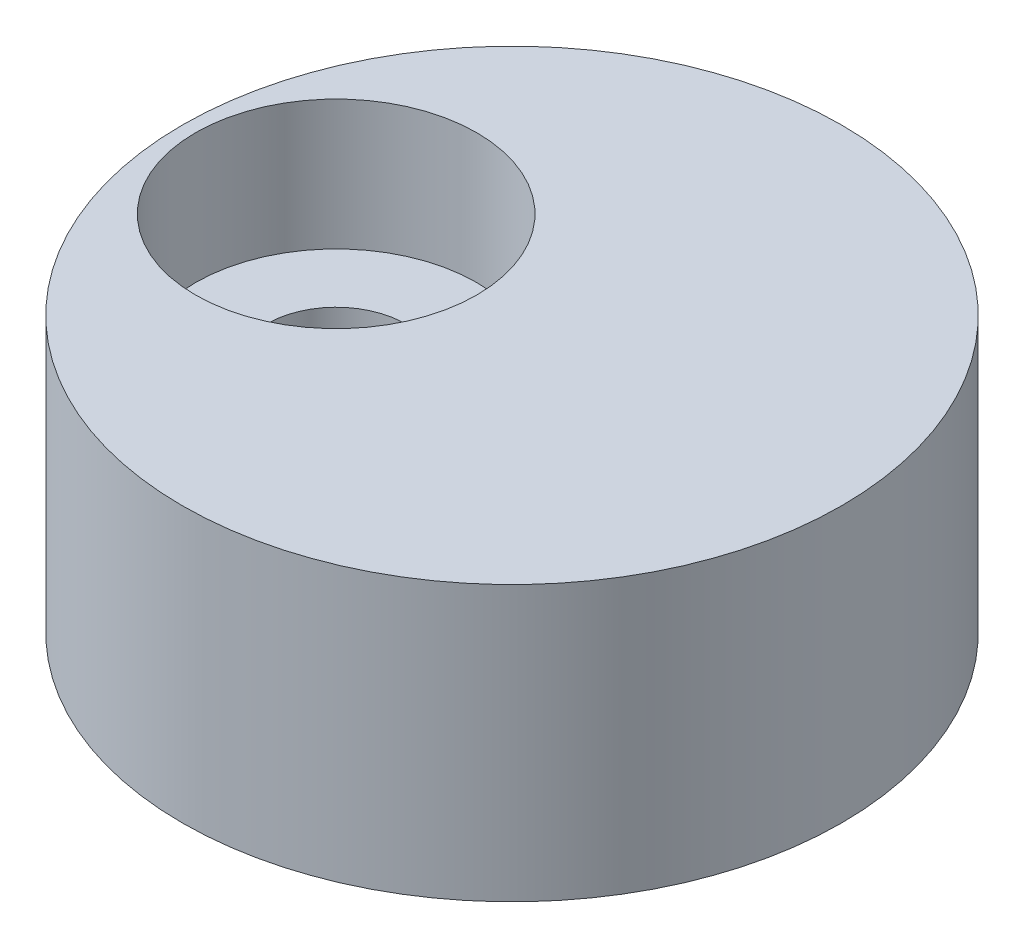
ISO-10303-21;
HEADER;
FILE_DESCRIPTION(('STEP AP214'),'2;1');
FILE_NAME('part.step','',(''),(''),'','','');
FILE_SCHEMA(('AUTOMOTIVE_DESIGN { 1 0 10303 214 1 1 1 1 }'));
ENDSEC;
DATA;
#1=APPLICATION_CONTEXT('core data for automotive mechanical design processes');
#2=APPLICATION_PROTOCOL_DEFINITION('international standard','automotive_design',2000,#1);
#3=PRODUCT_CONTEXT('',#1,'mechanical');
#4=PRODUCT('Part','Part','',(#3));
#5=PRODUCT_RELATED_PRODUCT_CATEGORY('part','',(#4));
#6=PRODUCT_DEFINITION_FORMATION('','',#4);
#7=PRODUCT_DEFINITION_CONTEXT('part definition',#1,'design');
#8=PRODUCT_DEFINITION('design','',#6,#7);
#9=PRODUCT_DEFINITION_SHAPE('','',#8);
#10=(LENGTH_UNIT() NAMED_UNIT(*) SI_UNIT(.MILLI.,.METRE.));
#11=(NAMED_UNIT(*) PLANE_ANGLE_UNIT() SI_UNIT($,.RADIAN.));
#12=(NAMED_UNIT(*) SI_UNIT($,.STERADIAN.) SOLID_ANGLE_UNIT());
#13=UNCERTAINTY_MEASURE_WITH_UNIT(LENGTH_MEASURE(1.E-05),#10,'distance_accuracy_value','');
#14=(GEOMETRIC_REPRESENTATION_CONTEXT(3) GLOBAL_UNCERTAINTY_ASSIGNED_CONTEXT((#13)) GLOBAL_UNIT_ASSIGNED_CONTEXT((#10,
#11,#12)) REPRESENTATION_CONTEXT('',''));
#15=CARTESIAN_POINT('',(0.,0.,0.));
#16=DIRECTION('',(0.,0.,1.));
#17=DIRECTION('',(1.,0.,0.));
#18=AXIS2_PLACEMENT_3D('',#15,#16,#17);
#19=CARTESIAN_POINT('',(0.,6.35,0.));
#20=DIRECTION('',(0.,-1.,0.));
#21=DIRECTION('',(0.,0.,-1.));
#22=AXIS2_PLACEMENT_3D('',#19,#20,#21);
#23=CYLINDRICAL_SURFACE('',#22,7.62);
#24=CARTESIAN_POINT('',(0.,6.35,0.));
#25=DIRECTION('',(0.,1.,0.));
#26=DIRECTION('',(0.,0.,1.));
#27=AXIS2_PLACEMENT_3D('',#24,#25,#26);
#28=CIRCLE('',#27,7.62);
#29=CARTESIAN_POINT('',(0.,6.35,7.62));
#30=VERTEX_POINT('',#29);
#31=EDGE_CURVE('E10',#30,#30,#28,.T.);
#32=ORIENTED_EDGE('',*,*,#31,.F.);
#33=EDGE_LOOP('',(#32));
#34=FACE_BOUND('',#33,.T.);
#35=CARTESIAN_POINT('',(0.,0.,0.));
#36=DIRECTION('',(0.,1.,0.));
#37=DIRECTION('',(0.,0.,1.));
#38=AXIS2_PLACEMENT_3D('',#35,#36,#37);
#39=CIRCLE('',#38,7.62);
#40=CARTESIAN_POINT('',(0.,0.,7.62));
#41=VERTEX_POINT('',#40);
#42=EDGE_CURVE('E32',#41,#41,#39,.T.);
#43=ORIENTED_EDGE('',*,*,#42,.T.);
#44=EDGE_LOOP('',(#43));
#45=FACE_BOUND('',#44,.T.);
#46=ADVANCED_FACE('F29',(#34,#45),#23,.T.);
#47=CARTESIAN_POINT('',(0.,6.35,0.));
#48=DIRECTION('',(0.,1.,0.));
#49=DIRECTION('',(0.,0.,1.));
#50=AXIS2_PLACEMENT_3D('',#47,#48,#49);
#51=PLANE('',#50);
#52=CARTESIAN_POINT('',(-4.064,6.35,0.));
#53=DIRECTION('',(0.,1.,0.));
#54=DIRECTION('',(0.,0.,1.));
#55=AXIS2_PLACEMENT_3D('',#52,#53,#54);
#56=CIRCLE('',#55,3.25);
#57=CARTESIAN_POINT('',(-4.064,6.35,3.25));
#58=VERTEX_POINT('',#57);
#59=EDGE_CURVE('E49',#58,#58,#56,.T.);
#60=ORIENTED_EDGE('',*,*,#59,.F.);
#61=EDGE_LOOP('',(#60));
#62=FACE_BOUND('',#61,.T.);
#63=ORIENTED_EDGE('',*,*,#31,.T.);
#64=EDGE_LOOP('',(#63));
#65=FACE_BOUND('',#64,.T.);
#66=ADVANCED_FACE('F55',(#62,#65),#51,.T.);
#67=CARTESIAN_POINT('',(0.,0.,0.));
#68=DIRECTION('',(0.,1.,0.));
#69=DIRECTION('',(0.,0.,1.));
#70=AXIS2_PLACEMENT_3D('',#67,#68,#69);
#71=PLANE('',#70);
#72=CARTESIAN_POINT('',(-4.064,0.,0.));
#73=DIRECTION('',(0.,1.,0.));
#74=DIRECTION('',(0.,0.,1.));
#75=AXIS2_PLACEMENT_3D('',#72,#73,#74);
#76=CIRCLE('',#75,1.6);
#77=CARTESIAN_POINT('',(-4.064,0.,1.6));
#78=VERTEX_POINT('',#77);
#79=EDGE_CURVE('E39',#78,#78,#76,.T.);
#80=ORIENTED_EDGE('',*,*,#79,.T.);
#81=EDGE_LOOP('',(#80));
#82=FACE_BOUND('',#81,.T.);
#83=ORIENTED_EDGE('',*,*,#42,.F.);
#84=EDGE_LOOP('',(#83));
#85=FACE_BOUND('',#84,.T.);
#86=ADVANCED_FACE('F57',(#82,#85),#71,.F.);
#87=CARTESIAN_POINT('',(-4.064,6.35,0.));
#88=DIRECTION('',(0.,1.,0.));
#89=DIRECTION('',(0.,0.,1.));
#90=AXIS2_PLACEMENT_3D('',#87,#88,#89);
#91=CYLINDRICAL_SURFACE('',#90,1.6);
#92=ORIENTED_EDGE('',*,*,#79,.F.);
#93=EDGE_LOOP('',(#92));
#94=FACE_BOUND('',#93,.T.);
#95=CARTESIAN_POINT('',(-4.064,3.35,0.));
#96=DIRECTION('',(0.,1.,0.));
#97=DIRECTION('',(0.,0.,1.));
#98=AXIS2_PLACEMENT_3D('',#95,#96,#97);
#99=CIRCLE('',#98,1.6);
#100=CARTESIAN_POINT('',(-4.064,3.35,1.6));
#101=VERTEX_POINT('',#100);
#102=EDGE_CURVE('E43',#101,#101,#99,.T.);
#103=ORIENTED_EDGE('',*,*,#102,.T.);
#104=EDGE_LOOP('',(#103));
#105=FACE_BOUND('',#104,.T.);
#106=ADVANCED_FACE('F63',(#94,#105),#91,.F.);
#107=CARTESIAN_POINT('',(-2.464,3.35,0.));
#108=DIRECTION('',(0.,-1.,0.));
#109=DIRECTION('',(0.,0.,-1.));
#110=AXIS2_PLACEMENT_3D('',#107,#108,#109);
#111=PLANE('',#110);
#112=ORIENTED_EDGE('',*,*,#102,.F.);
#113=EDGE_LOOP('',(#112));
#114=FACE_BOUND('',#113,.T.);
#115=CARTESIAN_POINT('',(-4.064,3.35,0.));
#116=DIRECTION('',(0.,1.,0.));
#117=DIRECTION('',(0.,0.,1.));
#118=AXIS2_PLACEMENT_3D('',#115,#116,#117);
#119=CIRCLE('',#118,3.25);
#120=CARTESIAN_POINT('',(-4.064,3.35,3.25));
#121=VERTEX_POINT('',#120);
#122=EDGE_CURVE('E46',#121,#121,#119,.T.);
#123=ORIENTED_EDGE('',*,*,#122,.T.);
#124=EDGE_LOOP('',(#123));
#125=FACE_BOUND('',#124,.T.);
#126=ADVANCED_FACE('F69',(#114,#125),#111,.F.);
#127=CARTESIAN_POINT('',(-4.064,6.35,0.));
#128=DIRECTION('',(0.,1.,0.));
#129=DIRECTION('',(0.,0.,1.));
#130=AXIS2_PLACEMENT_3D('',#127,#128,#129);
#131=CYLINDRICAL_SURFACE('',#130,3.25);
#132=ORIENTED_EDGE('',*,*,#122,.F.);
#133=EDGE_LOOP('',(#132));
#134=FACE_BOUND('',#133,.T.);
#135=ORIENTED_EDGE('',*,*,#59,.T.);
#136=EDGE_LOOP('',(#135));
#137=FACE_BOUND('',#136,.T.);
#138=ADVANCED_FACE('F53',(#134,#137),#131,.F.);
#139=CLOSED_SHELL('',(#46,#66,#86,#106,#126,#138));
#140=MANIFOLD_SOLID_BREP('B2',#139);
#141=ADVANCED_BREP_SHAPE_REPRESENTATION('',(#18,#140),#14);
#142=SHAPE_DEFINITION_REPRESENTATION(#9,#141);
ENDSEC;
END-ISO-10303-21;
